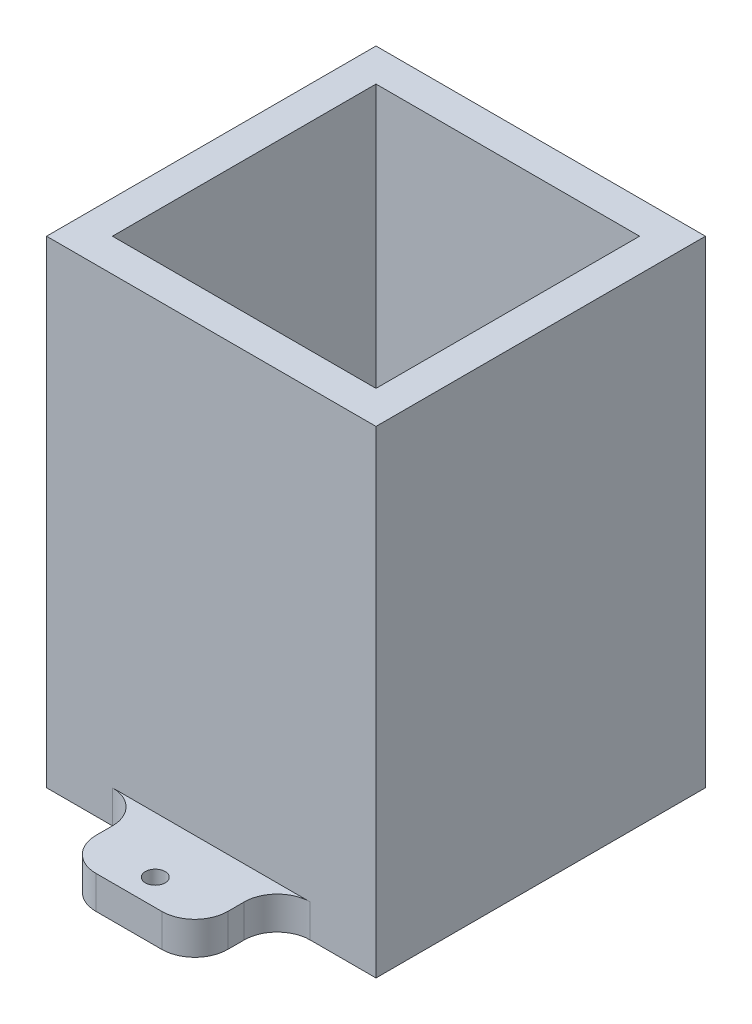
from build123d import *

# Parameters (mm, degrees)
SKETCH1_W           = 100
SKETCH1_H           = 100
SKETCH1_W_2         = 80
SKETCH1_H_2         = 80
BOSS_EXTRUDE1_DEPTH = 140
SKETCH2_W           = 100
SKETCH2_H           = 100
SKETCH2_R           = 25
BOSS_EXTRUDE2_DEPTH = 5
SKETCH3_W           = 40
SKETCH3_H           = 25
BOSS_EXTRUDE3_DEPTH = 10
SKETCH4_R           = 3
CUT_EXTRUDE1_DEPTH  = 10
FILLET1_R           = 10


with BuildPart() as part:
    # Sketch1 → Boss-Extrude1 (new body)
    with BuildSketch(Plane(origin=(0, 0, 0), x_dir=(1, 0, 0), z_dir=(0, 1, 0))):
        Rectangle(SKETCH1_W, SKETCH1_H)
        Rectangle(SKETCH1_W_2, SKETCH1_H_2, mode=Mode.SUBTRACT)
    extrude(amount=BOSS_EXTRUDE1_DEPTH)

    # Sketch2 → Boss-Extrude2 (add)
    with BuildSketch(Plane.XZ):
        Rectangle(SKETCH2_W, SKETCH2_H)
        with Locations(Location((0, 0, 0), (0, 0, 270))):
            Circle(SKETCH2_R, mode=Mode.SUBTRACT)
    extrude(amount=BOSS_EXTRUDE2_DEPTH)

    # Sketch3 → Boss-Extrude3 (add)
    with BuildSketch(Plane.XZ.offset(5)):
        with Locations((0, 62.5)):
            Rectangle(SKETCH3_W, SKETCH3_H)
        with Locations((0, -62.5)):
            Rectangle(SKETCH3_W, SKETCH3_H)
    extrude(amount=-BOSS_EXTRUDE3_DEPTH)

    # Sketch4 → Cut-Extrude1 (cut)
    with BuildSketch(Plane(origin=(0, 5, 0), x_dir=(1, 0, 0), z_dir=(0, 1, 0))):
        with Locations(Location((0, 67, 0), (0, 0, 270))):
            Circle(SKETCH4_R)
        with Locations(Location((0, -67, 0), (0, 0, 90))):
            Circle(SKETCH4_R)
    extrude(amount=-CUT_EXTRUDE1_DEPTH, mode=Mode.SUBTRACT)

    # Fillet1
    fillet1_edges = [part.edges().sort_by_distance(p)[0] for p in [
        (-20, 0, 50),
        (-20, 0, 75),
        (20, 0, 75),
        (20, 0, 50),
        (-20, 0, -50),
        (20, 0, -50),
        (20, 0, -75),
        (-20, 0, -75),
    ]]
    fillet(fillet1_edges, radius=FILLET1_R)


solid = part.part
